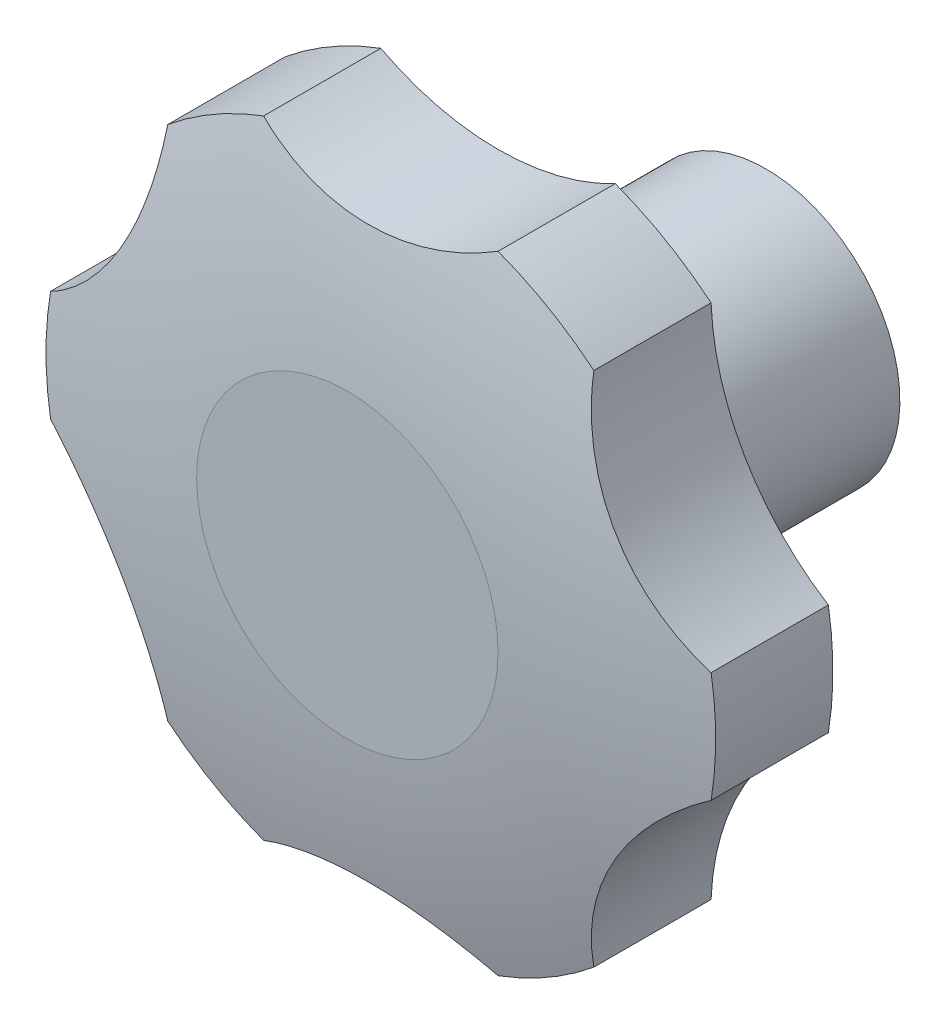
ISO-10303-21;
HEADER;
FILE_DESCRIPTION(('STEP AP214'),'2;1');
FILE_NAME('part.step','',(''),(''),'','','');
FILE_SCHEMA(('AUTOMOTIVE_DESIGN { 1 0 10303 214 1 1 1 1 }'));
ENDSEC;
DATA;
#1=APPLICATION_CONTEXT('core data for automotive mechanical design processes');
#2=APPLICATION_PROTOCOL_DEFINITION('international standard','automotive_design',2000,#1);
#3=PRODUCT_CONTEXT('',#1,'mechanical');
#4=PRODUCT('Part','Part','',(#3));
#5=PRODUCT_RELATED_PRODUCT_CATEGORY('part','',(#4));
#6=PRODUCT_DEFINITION_FORMATION('','',#4);
#7=PRODUCT_DEFINITION_CONTEXT('part definition',#1,'design');
#8=PRODUCT_DEFINITION('design','',#6,#7);
#9=PRODUCT_DEFINITION_SHAPE('','',#8);
#10=(LENGTH_UNIT() NAMED_UNIT(*) SI_UNIT(.MILLI.,.METRE.));
#11=(NAMED_UNIT(*) PLANE_ANGLE_UNIT() SI_UNIT($,.RADIAN.));
#12=(NAMED_UNIT(*) SI_UNIT($,.STERADIAN.) SOLID_ANGLE_UNIT());
#13=UNCERTAINTY_MEASURE_WITH_UNIT(LENGTH_MEASURE(1.E-05),#10,'distance_accuracy_value','');
#14=(GEOMETRIC_REPRESENTATION_CONTEXT(3) GLOBAL_UNCERTAINTY_ASSIGNED_CONTEXT((#13)) GLOBAL_UNIT_ASSIGNED_CONTEXT((#10,
#11,#12)) REPRESENTATION_CONTEXT('',''));
#15=CARTESIAN_POINT('',(0.,0.,0.));
#16=DIRECTION('',(0.,0.,1.));
#17=DIRECTION('',(1.,0.,0.));
#18=AXIS2_PLACEMENT_3D('',#15,#16,#17);
#19=CARTESIAN_POINT('',(0.,0.,30.));
#20=DIRECTION('',(0.,0.,1.));
#21=DIRECTION('',(0.,-1.,0.));
#22=AXIS2_PLACEMENT_3D('',#19,#20,#21);
#23=CYLINDRICAL_SURFACE('',#22,20.);
#24=DIRECTION('',(0.,0.,1.));
#25=VECTOR('',#24,1.);
#26=CARTESIAN_POINT('',(19.725272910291,-3.30357512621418,19.5));
#27=LINE('',#26,#25);
#28=CARTESIAN_POINT('',(19.725272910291,-3.30357512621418,16.));
#29=VERTEX_POINT('',#28);
#30=CARTESIAN_POINT('',(19.725272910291,-3.30357512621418,23.));
#31=VERTEX_POINT('',#30);
#32=EDGE_CURVE('E35',#29,#31,#27,.T.);
#33=ORIENTED_EDGE('',*,*,#32,.F.);
#34=CARTESIAN_POINT('',(0.,0.,16.));
#35=DIRECTION('',(0.,0.,1.));
#36=DIRECTION('',(0.,-1.,0.));
#37=AXIS2_PLACEMENT_3D('',#34,#35,#36);
#38=CIRCLE('',#37,20.);
#39=CARTESIAN_POINT('',(19.7252729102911,3.30357512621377,16.));
#40=VERTEX_POINT('',#39);
#41=EDGE_CURVE('E120',#29,#40,#38,.T.);
#42=ORIENTED_EDGE('',*,*,#41,.T.);
#43=DIRECTION('',(0.,0.,1.));
#44=VECTOR('',#43,1.);
#45=CARTESIAN_POINT('',(19.7252729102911,3.30357512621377,20.5));
#46=LINE('',#45,#44);
#47=CARTESIAN_POINT('',(19.7252729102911,3.30357512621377,23.));
#48=VERTEX_POINT('',#47);
#49=EDGE_CURVE('E257',#48,#40,#46,.F.);
#50=ORIENTED_EDGE('',*,*,#49,.F.);
#51=CARTESIAN_POINT('',(0.,0.,23.));
#52=DIRECTION('',(0.,0.,1.));
#53=DIRECTION('',(0.,-1.,0.));
#54=AXIS2_PLACEMENT_3D('',#51,#52,#53);
#55=CIRCLE('',#54,20.);
#56=EDGE_CURVE('E122',#31,#48,#55,.T.);
#57=ORIENTED_EDGE('',*,*,#56,.F.);
#58=EDGE_LOOP('',(#33,#42,#50,#57));
#59=FACE_BOUND('',#58,.T.);
#60=ADVANCED_FACE('F14',(#59),#23,.T.);
#61=DIRECTION('',(0.,0.,1.));
#62=VECTOR('',#61,1.);
#63=CARTESIAN_POINT('',(12.7236164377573,15.430799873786,20.5));
#64=LINE('',#63,#62);
#65=CARTESIAN_POINT('',(12.7236164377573,15.430799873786,16.));
#66=VERTEX_POINT('',#65);
#67=CARTESIAN_POINT('',(12.7236164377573,15.430799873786,23.));
#68=VERTEX_POINT('',#67);
#69=EDGE_CURVE('E42',#66,#68,#64,.T.);
#70=ORIENTED_EDGE('',*,*,#69,.F.);
#71=CARTESIAN_POINT('',(7.00165647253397,18.734375,16.));
#72=VERTEX_POINT('',#71);
#73=EDGE_CURVE('E130',#66,#72,#38,.T.);
#74=ORIENTED_EDGE('',*,*,#73,.T.);
#75=DIRECTION('',(0.,0.,1.));
#76=VECTOR('',#75,1.);
#77=CARTESIAN_POINT('',(7.00165647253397,18.734375,20.5));
#78=LINE('',#77,#76);
#79=CARTESIAN_POINT('',(7.00165647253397,18.734375,23.));
#80=VERTEX_POINT('',#79);
#81=EDGE_CURVE('E250',#80,#72,#78,.F.);
#82=ORIENTED_EDGE('',*,*,#81,.F.);
#83=EDGE_CURVE('E225',#68,#80,#55,.T.);
#84=ORIENTED_EDGE('',*,*,#83,.F.);
#85=EDGE_LOOP('',(#70,#74,#82,#84));
#86=FACE_BOUND('',#85,.T.);
#87=ADVANCED_FACE('F181',(#86),#23,.T.);
#88=DIRECTION('',(0.,0.,1.));
#89=VECTOR('',#88,1.);
#90=CARTESIAN_POINT('',(-7.00165647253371,18.734375,20.5));
#91=LINE('',#90,#89);
#92=CARTESIAN_POINT('',(-7.00165647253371,18.734375,16.));
#93=VERTEX_POINT('',#92);
#94=CARTESIAN_POINT('',(-7.00165647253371,18.734375,23.));
#95=VERTEX_POINT('',#94);
#96=EDGE_CURVE('E248',#93,#95,#91,.T.);
#97=ORIENTED_EDGE('',*,*,#96,.F.);
#98=CARTESIAN_POINT('',(-12.7236164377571,15.4307998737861,16.));
#99=VERTEX_POINT('',#98);
#100=EDGE_CURVE('E134',#93,#99,#38,.T.);
#101=ORIENTED_EDGE('',*,*,#100,.T.);
#102=DIRECTION('',(0.,0.,1.));
#103=VECTOR('',#102,1.);
#104=CARTESIAN_POINT('',(-12.7236164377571,15.4307998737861,20.5));
#105=LINE('',#104,#103);
#106=CARTESIAN_POINT('',(-12.7236164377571,15.4307998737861,23.));
#107=VERTEX_POINT('',#106);
#108=EDGE_CURVE('E242',#107,#99,#105,.F.);
#109=ORIENTED_EDGE('',*,*,#108,.F.);
#110=EDGE_CURVE('E229',#95,#107,#55,.T.);
#111=ORIENTED_EDGE('',*,*,#110,.F.);
#112=EDGE_LOOP('',(#97,#101,#109,#111));
#113=FACE_BOUND('',#112,.T.);
#114=ADVANCED_FACE('F185',(#113),#23,.T.);
#115=DIRECTION('',(0.,0.,1.));
#116=VECTOR('',#115,1.);
#117=CARTESIAN_POINT('',(-19.725272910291,3.30357512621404,20.5));
#118=LINE('',#117,#116);
#119=CARTESIAN_POINT('',(-19.725272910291,3.30357512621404,16.));
#120=VERTEX_POINT('',#119);
#121=CARTESIAN_POINT('',(-19.725272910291,3.30357512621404,23.));
#122=VERTEX_POINT('',#121);
#123=EDGE_CURVE('E240',#120,#122,#118,.T.);
#124=ORIENTED_EDGE('',*,*,#123,.F.);
#125=CARTESIAN_POINT('',(-19.7252729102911,-3.30357512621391,16.));
#126=VERTEX_POINT('',#125);
#127=EDGE_CURVE('E221',#120,#126,#38,.T.);
#128=ORIENTED_EDGE('',*,*,#127,.T.);
#129=DIRECTION('',(0.,0.,1.));
#130=VECTOR('',#129,1.);
#131=CARTESIAN_POINT('',(-19.725272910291,-3.30357512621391,19.5));
#132=LINE('',#131,#130);
#133=CARTESIAN_POINT('',(-19.7252729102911,-3.30357512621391,23.));
#134=VERTEX_POINT('',#133);
#135=EDGE_CURVE('E215',#134,#126,#132,.F.);
#136=ORIENTED_EDGE('',*,*,#135,.F.);
#137=EDGE_CURVE('E226',#122,#134,#55,.T.);
#138=ORIENTED_EDGE('',*,*,#137,.F.);
#139=EDGE_LOOP('',(#124,#128,#136,#138));
#140=FACE_BOUND('',#139,.T.);
#141=ADVANCED_FACE('F196',(#140),#23,.T.);
#142=DIRECTION('',(0.,0.,1.));
#143=VECTOR('',#142,1.);
#144=CARTESIAN_POINT('',(-12.7236164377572,-15.430799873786,19.5));
#145=LINE('',#144,#143);
#146=CARTESIAN_POINT('',(-12.7236164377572,-15.430799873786,16.));
#147=VERTEX_POINT('',#146);
#148=CARTESIAN_POINT('',(-12.7236164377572,-15.430799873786,23.));
#149=VERTEX_POINT('',#148);
#150=EDGE_CURVE('E206',#147,#149,#145,.T.);
#151=ORIENTED_EDGE('',*,*,#150,.F.);
#152=CARTESIAN_POINT('',(-7.00165647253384,-18.734375,16.));
#153=VERTEX_POINT('',#152);
#154=EDGE_CURVE('E133',#147,#153,#38,.T.);
#155=ORIENTED_EDGE('',*,*,#154,.T.);
#156=DIRECTION('',(0.,0.,1.));
#157=VECTOR('',#156,1.);
#158=CARTESIAN_POINT('',(-7.00165647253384,-18.734375,19.5));
#159=LINE('',#158,#157);
#160=CARTESIAN_POINT('',(-7.00165647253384,-18.734375,23.));
#161=VERTEX_POINT('',#160);
#162=EDGE_CURVE('E232',#161,#153,#159,.F.);
#163=ORIENTED_EDGE('',*,*,#162,.F.);
#164=EDGE_CURVE('E210',#149,#161,#55,.T.);
#165=ORIENTED_EDGE('',*,*,#164,.F.);
#166=EDGE_LOOP('',(#151,#155,#163,#165));
#167=FACE_BOUND('',#166,.T.);
#168=ADVANCED_FACE('F190',(#167),#23,.T.);
#169=CARTESIAN_POINT('',(0.,0.,0.));
#170=DIRECTION('',(0.,0.,1.));
#171=DIRECTION('',(0.,-1.,0.));
#172=AXIS2_PLACEMENT_3D('',#169,#170,#171);
#173=PLANE('',#172);
#174=CARTESIAN_POINT('',(0.,0.,0.));
#175=DIRECTION('',(0.,0.,-1.));
#176=DIRECTION('',(0.,1.,0.));
#177=AXIS2_PLACEMENT_3D('',#174,#175,#176);
#178=CIRCLE('',#177,2.5);
#179=CARTESIAN_POINT('',(0.,2.5,0.));
#180=VERTEX_POINT('',#179);
#181=EDGE_CURVE('E115',#180,#180,#178,.T.);
#182=ORIENTED_EDGE('',*,*,#181,.F.);
#183=EDGE_LOOP('',(#182));
#184=FACE_BOUND('',#183,.T.);
#185=CARTESIAN_POINT('',(0.,0.,0.));
#186=DIRECTION('',(0.,0.,1.));
#187=DIRECTION('',(0.,-1.,0.));
#188=AXIS2_PLACEMENT_3D('',#185,#186,#187);
#189=CIRCLE('',#188,8.);
#190=CARTESIAN_POINT('',(0.,-8.,0.));
#191=VERTEX_POINT('',#190);
#192=EDGE_CURVE('E141',#191,#191,#189,.T.);
#193=ORIENTED_EDGE('',*,*,#192,.F.);
#194=EDGE_LOOP('',(#193));
#195=FACE_BOUND('',#194,.T.);
#196=ADVANCED_FACE('F16',(#184,#195),#173,.F.);
#197=CARTESIAN_POINT('',(0.,0.,30.));
#198=DIRECTION('',(0.,0.,1.));
#199=DIRECTION('',(0.,-1.,0.));
#200=AXIS2_PLACEMENT_3D('',#197,#198,#199);
#201=CYLINDRICAL_SURFACE('',#200,8.);
#202=CARTESIAN_POINT('',(0.,0.,16.));
#203=DIRECTION('',(0.,0.,1.));
#204=DIRECTION('',(0.,-1.,0.));
#205=AXIS2_PLACEMENT_3D('',#202,#203,#204);
#206=CIRCLE('',#205,8.);
#207=CARTESIAN_POINT('',(0.,-8.,16.));
#208=VERTEX_POINT('',#207);
#209=EDGE_CURVE('E132',#208,#208,#206,.T.);
#210=ORIENTED_EDGE('',*,*,#209,.F.);
#211=EDGE_LOOP('',(#210));
#212=FACE_BOUND('',#211,.T.);
#213=ORIENTED_EDGE('',*,*,#192,.T.);
#214=EDGE_LOOP('',(#213));
#215=FACE_BOUND('',#214,.T.);
#216=ADVANCED_FACE('F194',(#212,#215),#201,.T.);
#217=CARTESIAN_POINT('',(8.,0.,16.));
#218=DIRECTION('',(0.,0.,1.));
#219=DIRECTION('',(0.,-1.,0.));
#220=AXIS2_PLACEMENT_3D('',#217,#218,#219);
#221=PLANE('',#220);
#222=ORIENTED_EDGE('',*,*,#41,.F.);
#223=CARTESIAN_POINT('',(27.7128129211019,-16.0000000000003,16.));
#224=DIRECTION('',(0.,0.,1.));
#225=DIRECTION('',(0.866025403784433,-0.50000000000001,0.));
#226=AXIS2_PLACEMENT_3D('',#223,#224,#225);
#227=CIRCLE('',#226,15.);
#228=CARTESIAN_POINT('',(12.723616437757,-15.4307998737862,16.));
#229=VERTEX_POINT('',#228);
#230=EDGE_CURVE('E107',#29,#229,#227,.T.);
#231=ORIENTED_EDGE('',*,*,#230,.T.);
#232=CARTESIAN_POINT('',(7.00165647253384,-18.734375,16.));
#233=VERTEX_POINT('',#232);
#234=EDGE_CURVE('E129',#233,#229,#38,.T.);
#235=ORIENTED_EDGE('',*,*,#234,.F.);
#236=CARTESIAN_POINT('',(0.,-32.,16.));
#237=DIRECTION('',(0.,0.,1.));
#238=DIRECTION('',(0.,-1.,0.));
#239=AXIS2_PLACEMENT_3D('',#236,#237,#238);
#240=CIRCLE('',#239,15.);
#241=EDGE_CURVE('E214',#233,#153,#240,.T.);
#242=ORIENTED_EDGE('',*,*,#241,.T.);
#243=ORIENTED_EDGE('',*,*,#154,.F.);
#244=CARTESIAN_POINT('',(-27.7128129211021,-16.,16.));
#245=DIRECTION('',(0.,0.,1.));
#246=DIRECTION('',(-0.86602540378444,-0.5,0.));
#247=AXIS2_PLACEMENT_3D('',#244,#245,#246);
#248=CIRCLE('',#247,15.);
#249=EDGE_CURVE('E220',#147,#126,#248,.T.);
#250=ORIENTED_EDGE('',*,*,#249,.T.);
#251=ORIENTED_EDGE('',*,*,#127,.F.);
#252=CARTESIAN_POINT('',(-27.7128129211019,16.,16.));
#253=DIRECTION('',(0.,0.,1.));
#254=DIRECTION('',(-0.866025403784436,0.5,0.));
#255=AXIS2_PLACEMENT_3D('',#252,#253,#254);
#256=CIRCLE('',#255,15.);
#257=EDGE_CURVE('E245',#120,#99,#256,.T.);
#258=ORIENTED_EDGE('',*,*,#257,.T.);
#259=ORIENTED_EDGE('',*,*,#100,.F.);
#260=CARTESIAN_POINT('',(2.23454935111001E-13,32.,16.));
#261=DIRECTION('',(0.,0.,1.));
#262=DIRECTION('',(0.,1.,0.));
#263=AXIS2_PLACEMENT_3D('',#260,#261,#262);
#264=CIRCLE('',#263,15.);
#265=EDGE_CURVE('E253',#93,#72,#264,.T.);
#266=ORIENTED_EDGE('',*,*,#265,.T.);
#267=ORIENTED_EDGE('',*,*,#73,.F.);
#268=CARTESIAN_POINT('',(27.7128129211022,15.9999999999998,16.));
#269=DIRECTION('',(0.,0.,1.));
#270=DIRECTION('',(0.866025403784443,0.499999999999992,0.));
#271=AXIS2_PLACEMENT_3D('',#268,#269,#270);
#272=CIRCLE('',#271,15.);
#273=EDGE_CURVE('E123',#66,#40,#272,.T.);
#274=ORIENTED_EDGE('',*,*,#273,.T.);
#275=EDGE_LOOP('',(#222,#231,#235,#242,#243,#250,#251,#258,#259,#266,#267,#274));
#276=FACE_BOUND('',#275,.T.);
#277=ORIENTED_EDGE('',*,*,#209,.T.);
#278=EDGE_LOOP('',(#277));
#279=FACE_BOUND('',#278,.T.);
#280=ADVANCED_FACE('F126',(#276,#279),#221,.F.);
#281=DIRECTION('',(0.,0.,1.));
#282=VECTOR('',#281,1.);
#283=CARTESIAN_POINT('',(12.723616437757,-15.4307998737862,19.5));
#284=LINE('',#283,#282);
#285=CARTESIAN_POINT('',(12.723616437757,-15.4307998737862,23.));
#286=VERTEX_POINT('',#285);
#287=EDGE_CURVE('E110',#286,#229,#284,.F.);
#288=ORIENTED_EDGE('',*,*,#287,.F.);
#289=CARTESIAN_POINT('',(7.00165647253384,-18.734375,23.));
#290=VERTEX_POINT('',#289);
#291=EDGE_CURVE('E137',#290,#286,#55,.T.);
#292=ORIENTED_EDGE('',*,*,#291,.F.);
#293=DIRECTION('',(0.,0.,1.));
#294=VECTOR('',#293,1.);
#295=CARTESIAN_POINT('',(7.00165647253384,-18.734375,19.5));
#296=LINE('',#295,#294);
#297=EDGE_CURVE('E230',#233,#290,#296,.T.);
#298=ORIENTED_EDGE('',*,*,#297,.F.);
#299=ORIENTED_EDGE('',*,*,#234,.T.);
#300=EDGE_LOOP('',(#288,#292,#298,#299));
#301=FACE_BOUND('',#300,.T.);
#302=ADVANCED_FACE('F177',(#301),#23,.T.);
#303=CARTESIAN_POINT('',(0.,0.,-34.7754200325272));
#304=DIRECTION('',(0.,0.,1.));
#305=DIRECTION('',(0.,-1.,0.));
#306=AXIS2_PLACEMENT_3D('',#303,#304,#305);
#307=DEGENERATE_TOROIDAL_SURFACE('',#306,3.81355999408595,60.,.T.);
#308=CARTESIAN_POINT('',(0.,0.,25.));
#309=DIRECTION('',(0.,0.,1.));
#310=DIRECTION('',(0.,-1.,0.));
#311=AXIS2_PLACEMENT_3D('',#308,#309,#310);
#312=CIRCLE('',#311,9.);
#313=CARTESIAN_POINT('',(0.,-9.,25.));
#314=VERTEX_POINT('',#313);
#315=EDGE_CURVE('E227',#314,#314,#312,.T.);
#316=ORIENTED_EDGE('',*,*,#315,.F.);
#317=EDGE_LOOP('',(#316));
#318=FACE_BOUND('',#317,.T.);
#319=ORIENTED_EDGE('',*,*,#291,.T.);
#320=CARTESIAN_POINT('',(12.7235801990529,-15.4317549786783,22.9998));
#321=CARTESIAN_POINT('',(12.731643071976,-15.2190560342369,23.0443428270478));
#322=CARTESIAN_POINT('',(12.7442494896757,-15.0061613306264,23.0869884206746));
#323=CARTESIAN_POINT('',(12.7786141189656,-14.5803741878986,23.1684407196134));
#324=CARTESIAN_POINT('',(12.8003724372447,-14.3674817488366,23.2072473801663));
#325=CARTESIAN_POINT('',(12.8794694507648,-13.7294254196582,23.3178374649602));
#326=CARTESIAN_POINT('',(12.9506309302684,-13.3048629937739,23.3837950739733));
#327=CARTESIAN_POINT('',(13.1295422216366,-12.4626088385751,23.499669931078));
#328=CARTESIAN_POINT('',(13.2371900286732,-12.0449013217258,23.5496311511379));
#329=CARTESIAN_POINT('',(13.4886260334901,-11.2189142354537,23.6336334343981));
#330=CARTESIAN_POINT('',(13.6324073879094,-10.8106328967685,23.6676775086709));
#331=CARTESIAN_POINT('',(13.9409940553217,-10.0423933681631,23.7175269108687));
#332=CARTESIAN_POINT('',(14.1028550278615,-9.68133477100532,23.7346685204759));
#333=CARTESIAN_POINT('',(14.4547808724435,-8.97283754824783,23.7556720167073));
#334=CARTESIAN_POINT('',(14.644844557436,-8.6253983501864,23.7595344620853));
#335=CARTESIAN_POINT('',(15.0517637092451,-7.94678085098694,23.7539814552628));
#336=CARTESIAN_POINT('',(15.2686143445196,-7.61559963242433,23.744568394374));
#337=CARTESIAN_POINT('',(15.7274647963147,-6.97184030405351,23.7124675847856));
#338=CARTESIAN_POINT('',(15.9694638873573,-6.65926165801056,23.6897802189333));
#339=CARTESIAN_POINT('',(16.4748083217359,-6.05713406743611,23.6313579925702));
#340=CARTESIAN_POINT('',(16.7379819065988,-5.76743141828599,23.5957212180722));
#341=CARTESIAN_POINT('',(17.2851098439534,-5.21040088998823,23.5114304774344));
#342=CARTESIAN_POINT('',(17.5690654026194,-4.94307431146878,23.462775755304));
#343=CARTESIAN_POINT('',(18.1560265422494,-4.43196238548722,23.3524643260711));
#344=CARTESIAN_POINT('',(18.4590652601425,-4.18821996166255,23.2907845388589));
#345=CARTESIAN_POINT('',(18.9256137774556,-3.84176407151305,23.1887518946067));
#346=CARTESIAN_POINT('',(19.0831380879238,-3.72946561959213,23.1531531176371));
#347=CARTESIAN_POINT('',(19.4018964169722,-3.51136708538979,23.0788199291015));
#348=CARTESIAN_POINT('',(19.5631303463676,-3.40556684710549,23.0400855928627));
#349=CARTESIAN_POINT('',(19.7260819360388,-3.30306619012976,22.9998));
#350=B_SPLINE_CURVE_WITH_KNOTS('',3,(#320,#321,#322,#323,#324,#325,#326,#327,#328,#329,#330,
#331,#332,#333,#334,#335,#336,#337,#338,#339,#340,#341,#342,#343,#344,#345,#346,#347,#348,#349),
.UNSPECIFIED.,.F.,.F.,(4,2,2,2,2,2,2,2,2,2,2,2,2,2,4),(0.,0.652272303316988,1.30455221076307,
2.60905237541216,3.90993522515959,5.210571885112,6.39729252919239,7.58396323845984,
8.77042022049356,9.95684298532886,11.1344603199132,12.3121460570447,13.4919364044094,
14.081901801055,14.6718530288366),.UNSPECIFIED.);
#351=EDGE_CURVE('E9',#286,#31,#350,.T.);
#352=ORIENTED_EDGE('',*,*,#351,.T.);
#353=ORIENTED_EDGE('',*,*,#56,.T.);
#354=CARTESIAN_POINT('',(19.7260819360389,3.30306619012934,22.9998));
#355=CARTESIAN_POINT('',(19.545910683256,3.41639831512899,23.0443428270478));
#356=CARTESIAN_POINT('',(19.3678416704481,3.5337631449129,23.0869884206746));
#357=CARTESIAN_POINT('',(19.0162815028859,3.77641735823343,23.1684407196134));
#358=CARTESIAN_POINT('',(18.8427904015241,3.9017068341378,23.2072473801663));
#359=CARTESIAN_POINT('',(18.3297659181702,4.28923502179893,23.3178374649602));
#360=CARTESIAN_POINT('',(17.9976648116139,4.56314388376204,23.3837950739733));
#361=CARTESIAN_POINT('',(17.3577069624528,5.13921268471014,23.499669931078));
#362=CARTESIAN_POINT('',(17.049785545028,5.44129217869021,23.5496311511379));
#363=CARTESIAN_POINT('',(16.4601777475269,6.07203568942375,23.6336334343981));
#364=CARTESIAN_POINT('',(16.178486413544,6.40069466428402,23.6676775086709));
#365=CARTESIAN_POINT('',(15.6674647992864,7.05205832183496,23.7175269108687));
#366=CARTESIAN_POINT('',(15.435709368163,7.37276333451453,23.7346685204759));
#367=CARTESIAN_POINT('',(14.9980956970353,8.03178866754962,23.7556720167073));
#368=CARTESIAN_POINT('',(14.7922363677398,8.37010824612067,23.7595344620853));
#369=CARTESIAN_POINT('',(14.407995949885,9.06181931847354,23.7539814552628));
#370=CARTESIAN_POINT('',(14.2296099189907,9.41520808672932,23.744568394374));
#371=CARTESIAN_POINT('',(13.9015232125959,10.1344638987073,23.7124675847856));
#372=CARTESIAN_POINT('',(13.7518217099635,10.5003305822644,23.6897802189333));
#373=CARTESIAN_POINT('',(13.4830361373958,11.2390354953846,23.6313579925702));
#374=CARTESIAN_POINT('',(13.3637330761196,11.6118018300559,23.5957212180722));
#375=CARTESIAN_POINT('',(13.1548944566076,12.364143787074,23.5114304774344));
#376=CARTESIAN_POINT('',(13.065360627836,12.7437198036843,23.462775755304));
#377=CARTESIAN_POINT('',(12.9162052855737,13.5075990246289,23.3524643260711));
#378=CARTESIAN_POINT('',(12.8566375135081,13.891909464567,23.2907845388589));
#379=CARTESIAN_POINT('',(12.7898721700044,14.4691802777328,23.1887518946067));
#380=CARTESIAN_POINT('',(12.7713810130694,14.6617495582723,23.1531531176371));
#381=CARTESIAN_POINT('',(12.7418813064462,15.0468516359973,23.0788199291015));
#382=CARTESIAN_POINT('',(12.7308725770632,15.2393844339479,23.0400855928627));
#383=CARTESIAN_POINT('',(12.7235801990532,15.4317549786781,22.9998));
#384=B_SPLINE_CURVE_WITH_KNOTS('',3,(#354,#355,#356,#357,#358,#359,#360,#361,#362,#363,#364,
#365,#366,#367,#368,#369,#370,#371,#372,#373,#374,#375,#376,#377,#378,#379,#380,#381,#382,#383),
.UNSPECIFIED.,.F.,.F.,(4,2,2,2,2,2,2,2,2,2,2,2,2,2,4),(0.,0.652272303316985,1.30455221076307,
2.60905237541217,3.9099352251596,5.21057188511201,6.3972925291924,7.58396323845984,
8.77042022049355,9.95684298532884,11.1344603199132,12.3121460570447,13.4919364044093,
14.081901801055,14.6718530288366),.UNSPECIFIED.);
#385=EDGE_CURVE('E28',#48,#68,#384,.T.);
#386=ORIENTED_EDGE('',*,*,#385,.T.);
#387=ORIENTED_EDGE('',*,*,#83,.T.);
#388=CARTESIAN_POINT('',(7.00250173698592,18.7348211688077,22.9998));
#389=CARTESIAN_POINT('',(6.81426761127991,18.6354543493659,23.0443428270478));
#390=CARTESIAN_POINT('',(6.62359218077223,18.5399244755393,23.0869884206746));
#391=CARTESIAN_POINT('',(6.23766738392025,18.356791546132,23.1684407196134));
#392=CARTESIAN_POINT('',(6.04241796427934,18.2691885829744,23.2072473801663));
#393=CARTESIAN_POINT('',(5.45029646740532,18.0186604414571,23.3178374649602));
#394=CARTESIAN_POINT('',(5.04703388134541,17.8680068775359,23.3837950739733));
#395=CARTESIAN_POINT('',(4.22816474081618,17.6018215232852,23.499669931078));
#396=CARTESIAN_POINT('',(3.81259551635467,17.486193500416,23.5496311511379));
#397=CARTESIAN_POINT('',(2.97155171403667,17.2909499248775,23.6336334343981));
#398=CARTESIAN_POINT('',(2.5460790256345,17.2113275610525,23.6676775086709));
#399=CARTESIAN_POINT('',(1.72647074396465,17.094451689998,23.7175269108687));
#400=CARTESIAN_POINT('',(1.33285434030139,17.0540981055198,23.7346685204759));
#401=CARTESIAN_POINT('',(0.543314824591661,17.0046262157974,23.7556720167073));
#402=CARTESIAN_POINT('',(0.147391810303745,16.995506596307,23.7595344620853));
#403=CARTESIAN_POINT('',(-0.643767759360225,17.0086001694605,23.7539814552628));
#404=CARTESIAN_POINT('',(-1.03900442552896,17.0308077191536,23.744568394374));
#405=CARTESIAN_POINT('',(-1.82594158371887,17.1063042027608,23.7124675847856));
#406=CARTESIAN_POINT('',(-2.21764217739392,17.1595922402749,23.6897802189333));
#407=CARTESIAN_POINT('',(-2.99177218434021,17.2961695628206,23.6313579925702));
#408=CARTESIAN_POINT('',(-3.37424883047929,17.3792332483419,23.5957212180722));
#409=CARTESIAN_POINT('',(-4.13021538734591,17.5745446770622,23.5114304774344));
#410=CARTESIAN_POINT('',(-4.50370477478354,17.6867941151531,23.462775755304));
#411=CARTESIAN_POINT('',(-5.23982125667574,17.9395614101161,23.3524643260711));
#412=CARTESIAN_POINT('',(-5.60242774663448,18.0801294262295,23.2907845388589));
#413=CARTESIAN_POINT('',(-6.13574160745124,18.3109443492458,23.1887518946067));
#414=CARTESIAN_POINT('',(-6.31175707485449,18.3912151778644,23.1531531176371));
#415=CARTESIAN_POINT('',(-6.66001511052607,18.5582187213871,23.0788199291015));
#416=CARTESIAN_POINT('',(-6.83225776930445,18.6449512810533,23.0400855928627));
#417=CARTESIAN_POINT('',(-7.00250173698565,18.7348211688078,22.9998));
#418=B_SPLINE_CURVE_WITH_KNOTS('',3,(#388,#389,#390,#391,#392,#393,#394,#395,#396,#397,#398,
#399,#400,#401,#402,#403,#404,#405,#406,#407,#408,#409,#410,#411,#412,#413,#414,#415,#416,#417),
.UNSPECIFIED.,.F.,.F.,(4,2,2,2,2,2,2,2,2,2,2,2,2,2,4),(0.,0.65227230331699,1.30455221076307,
2.60905237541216,3.9099352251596,5.21057188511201,6.39729252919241,7.58396323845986,
8.77042022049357,9.95684298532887,11.1344603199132,12.3121460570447,13.4919364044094,
14.081901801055,14.6718530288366),.UNSPECIFIED.);
#419=EDGE_CURVE('E291',#80,#95,#418,.T.);
#420=ORIENTED_EDGE('',*,*,#419,.T.);
#421=ORIENTED_EDGE('',*,*,#110,.T.);
#422=CARTESIAN_POINT('',(-12.723580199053,15.4317549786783,22.9998));
#423=CARTESIAN_POINT('',(-12.7316430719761,15.2190560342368,23.0443428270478));
#424=CARTESIAN_POINT('',(-12.7442494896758,15.0061613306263,23.0869884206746));
#425=CARTESIAN_POINT('',(-12.7786141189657,14.5803741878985,23.1684407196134));
#426=CARTESIAN_POINT('',(-12.8003724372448,14.3674817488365,23.2072473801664));
#427=CARTESIAN_POINT('',(-12.8794694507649,13.7294254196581,23.3178374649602));
#428=CARTESIAN_POINT('',(-12.9506309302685,13.3048629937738,23.3837950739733));
#429=CARTESIAN_POINT('',(-13.1295422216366,12.462608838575,23.499669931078));
#430=CARTESIAN_POINT('',(-13.2371900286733,12.0449013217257,23.5496311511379));
#431=CARTESIAN_POINT('',(-13.4886260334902,11.2189142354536,23.6336334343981));
#432=CARTESIAN_POINT('',(-13.6324073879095,10.8106328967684,23.6676775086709));
#433=CARTESIAN_POINT('',(-13.9409940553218,10.0423933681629,23.7175269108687));
#434=CARTESIAN_POINT('',(-14.1028550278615,9.6813347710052,23.7346685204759));
#435=CARTESIAN_POINT('',(-14.4547808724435,8.97283754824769,23.7556720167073));
#436=CARTESIAN_POINT('',(-14.644844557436,8.62539835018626,23.7595344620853));
#437=CARTESIAN_POINT('',(-15.0517637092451,7.94678085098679,23.7539814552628));
#438=CARTESIAN_POINT('',(-15.2686143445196,7.61559963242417,23.744568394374));
#439=CARTESIAN_POINT('',(-15.7274647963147,6.97184030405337,23.7124675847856));
#440=CARTESIAN_POINT('',(-15.9694638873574,6.65926165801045,23.6897802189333));
#441=CARTESIAN_POINT('',(-16.474808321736,6.05713406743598,23.6313579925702));
#442=CARTESIAN_POINT('',(-16.7379819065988,5.76743141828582,23.5957212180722));
#443=CARTESIAN_POINT('',(-17.2851098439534,5.21040088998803,23.5114304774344));
#444=CARTESIAN_POINT('',(-17.5690654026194,4.94307431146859,23.4627757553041));
#445=CARTESIAN_POINT('',(-18.1560265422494,4.43196238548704,23.3524643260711));
#446=CARTESIAN_POINT('',(-18.4590652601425,4.18821996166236,23.2907845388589));
#447=CARTESIAN_POINT('',(-18.9256137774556,3.84176407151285,23.1887518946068));
#448=CARTESIAN_POINT('',(-19.0831380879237,3.72946561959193,23.1531531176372));
#449=CARTESIAN_POINT('',(-19.4018964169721,3.5113670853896,23.0788199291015));
#450=CARTESIAN_POINT('',(-19.5631303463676,3.40556684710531,23.0400855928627));
#451=CARTESIAN_POINT('',(-19.7260819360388,3.30306619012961,22.9998));
#452=B_SPLINE_CURVE_WITH_KNOTS('',3,(#422,#423,#424,#425,#426,#427,#428,#429,#430,#431,#432,
#433,#434,#435,#436,#437,#438,#439,#440,#441,#442,#443,#444,#445,#446,#447,#448,#449,#450,#451),
.UNSPECIFIED.,.F.,.F.,(4,2,2,2,2,2,2,2,2,2,2,2,2,2,4),(0.,0.652272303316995,1.30455221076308,
2.60905237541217,3.90993522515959,5.210571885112,6.39729252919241,7.58396323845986,
8.77042022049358,9.95684298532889,11.1344603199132,12.3121460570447,13.4919364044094,
14.081901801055,14.6718530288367),.UNSPECIFIED.);
#453=EDGE_CURVE('E297',#107,#122,#452,.T.);
#454=ORIENTED_EDGE('',*,*,#453,.T.);
#455=ORIENTED_EDGE('',*,*,#137,.T.);
#456=CARTESIAN_POINT('',(-19.7260819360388,-3.30306619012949,22.9998));
#457=CARTESIAN_POINT('',(-19.545910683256,-3.41639831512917,23.0443428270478));
#458=CARTESIAN_POINT('',(-19.367841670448,-3.53376314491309,23.0869884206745));
#459=CARTESIAN_POINT('',(-19.0162815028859,-3.77641735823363,23.1684407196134));
#460=CARTESIAN_POINT('',(-18.8427904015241,-3.90170683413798,23.2072473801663));
#461=CARTESIAN_POINT('',(-18.3297659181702,-4.2892350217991,23.3178374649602));
#462=CARTESIAN_POINT('',(-17.9976648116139,-4.56314388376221,23.3837950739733));
#463=CARTESIAN_POINT('',(-17.3577069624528,-5.13921268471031,23.499669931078));
#464=CARTESIAN_POINT('',(-17.049785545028,-5.44129217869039,23.5496311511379));
#465=CARTESIAN_POINT('',(-16.4601777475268,-6.0720356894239,23.6336334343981));
#466=CARTESIAN_POINT('',(-16.1784864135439,-6.40069466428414,23.6676775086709));
#467=CARTESIAN_POINT('',(-15.6674647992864,-7.05205832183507,23.7175269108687));
#468=CARTESIAN_POINT('',(-15.4357093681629,-7.37276333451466,23.7346685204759));
#469=CARTESIAN_POINT('',(-14.9980956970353,-8.03178866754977,23.7556720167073));
#470=CARTESIAN_POINT('',(-14.7922363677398,-8.37010824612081,23.7595344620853));
#471=CARTESIAN_POINT('',(-14.4079959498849,-9.06181931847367,23.7539814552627));
#472=CARTESIAN_POINT('',(-14.2296099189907,-9.41520808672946,23.744568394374));
#473=CARTESIAN_POINT('',(-13.9015232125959,-10.1344638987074,23.7124675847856));
#474=CARTESIAN_POINT('',(-13.7518217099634,-10.5003305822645,23.6897802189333));
#475=CARTESIAN_POINT('',(-13.4830361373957,-11.2390354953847,23.6313579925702));
#476=CARTESIAN_POINT('',(-13.3637330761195,-11.611801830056,23.5957212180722));
#477=CARTESIAN_POINT('',(-13.1548944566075,-12.3641437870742,23.5114304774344));
#478=CARTESIAN_POINT('',(-13.0653606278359,-12.7437198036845,23.462775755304));
#479=CARTESIAN_POINT('',(-12.9162052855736,-13.507599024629,23.352464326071));
#480=CARTESIAN_POINT('',(-12.856637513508,-13.8919094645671,23.2907845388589));
#481=CARTESIAN_POINT('',(-12.7898721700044,-14.4691802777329,23.1887518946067));
#482=CARTESIAN_POINT('',(-12.7713810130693,-14.6617495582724,23.1531531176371));
#483=CARTESIAN_POINT('',(-12.7418813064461,-15.0468516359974,23.0788199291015));
#484=CARTESIAN_POINT('',(-12.7308725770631,-15.239384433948,23.0400855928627));
#485=CARTESIAN_POINT('',(-12.7235801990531,-15.4317549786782,22.9998));
#486=B_SPLINE_CURVE_WITH_KNOTS('',3,(#456,#457,#458,#459,#460,#461,#462,#463,#464,#465,#466,
#467,#468,#469,#470,#471,#472,#473,#474,#475,#476,#477,#478,#479,#480,#481,#482,#483,#484,#485),
.UNSPECIFIED.,.F.,.F.,(4,2,2,2,2,2,2,2,2,2,2,2,2,2,4),(0.,0.652272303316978,1.30455221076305,
2.60905237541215,3.90993522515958,5.21057188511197,6.39729252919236,7.58396323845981,
8.77042022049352,9.95684298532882,11.1344603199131,12.3121460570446,13.4919364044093,
14.081901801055,14.6718530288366),.UNSPECIFIED.);
#487=EDGE_CURVE('E152',#134,#149,#486,.T.);
#488=ORIENTED_EDGE('',*,*,#487,.T.);
#489=ORIENTED_EDGE('',*,*,#164,.T.);
#490=CARTESIAN_POINT('',(-7.00250173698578,-18.7348211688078,22.9998));
#491=CARTESIAN_POINT('',(-6.81426761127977,-18.6354543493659,23.0443428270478));
#492=CARTESIAN_POINT('',(-6.62359218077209,-18.5399244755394,23.0869884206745));
#493=CARTESIAN_POINT('',(-6.23766738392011,-18.3567915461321,23.1684407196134));
#494=CARTESIAN_POINT('',(-6.04241796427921,-18.2691885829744,23.2072473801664));
#495=CARTESIAN_POINT('',(-5.45029646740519,-18.0186604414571,23.3178374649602));
#496=CARTESIAN_POINT('',(-5.04703388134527,-17.868006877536,23.3837950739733));
#497=CARTESIAN_POINT('',(-4.22816474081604,-17.6018215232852,23.499669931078));
#498=CARTESIAN_POINT('',(-3.81259551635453,-17.4861935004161,23.5496311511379));
#499=CARTESIAN_POINT('',(-2.97155171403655,-17.2909499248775,23.6336334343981));
#500=CARTESIAN_POINT('',(-2.54607902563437,-17.2113275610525,23.6676775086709));
#501=CARTESIAN_POINT('',(-1.72647074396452,-17.094451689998,23.7175269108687));
#502=CARTESIAN_POINT('',(-1.33285434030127,-17.0540981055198,23.7346685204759));
#503=CARTESIAN_POINT('',(-0.543314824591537,-17.0046262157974,23.7556720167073));
#504=CARTESIAN_POINT('',(-0.147391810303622,-16.995506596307,23.7595344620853));
#505=CARTESIAN_POINT('',(0.643767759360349,-17.0086001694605,23.7539814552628));
#506=CARTESIAN_POINT('',(1.03900442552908,-17.0308077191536,23.744568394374));
#507=CARTESIAN_POINT('',(1.825941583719,-17.1063042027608,23.7124675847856));
#508=CARTESIAN_POINT('',(2.21764217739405,-17.1595922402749,23.6897802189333));
#509=CARTESIAN_POINT('',(2.99177218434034,-17.2961695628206,23.6313579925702));
#510=CARTESIAN_POINT('',(3.37424883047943,-17.3792332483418,23.5957212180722));
#511=CARTESIAN_POINT('',(4.13021538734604,-17.5745446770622,23.5114304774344));
#512=CARTESIAN_POINT('',(4.50370477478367,-17.6867941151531,23.462775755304));
#513=CARTESIAN_POINT('',(5.23982125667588,-17.9395614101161,23.3524643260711));
#514=CARTESIAN_POINT('',(5.60242774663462,-18.0801294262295,23.2907845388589));
#515=CARTESIAN_POINT('',(6.13574160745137,-18.3109443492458,23.1887518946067));
#516=CARTESIAN_POINT('',(6.31175707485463,-18.3912151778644,23.1531531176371));
#517=CARTESIAN_POINT('',(6.66001511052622,-18.558218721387,23.0788199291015));
#518=CARTESIAN_POINT('',(6.83225776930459,-18.6449512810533,23.0400855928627));
#519=CARTESIAN_POINT('',(7.0025017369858,-18.7348211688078,22.9998));
#520=B_SPLINE_CURVE_WITH_KNOTS('',3,(#490,#491,#492,#493,#494,#495,#496,#497,#498,#499,#500,
#501,#502,#503,#504,#505,#506,#507,#508,#509,#510,#511,#512,#513,#514,#515,#516,#517,#518,#519),
.UNSPECIFIED.,.F.,.F.,(4,2,2,2,2,2,2,2,2,2,2,2,2,2,4),(0.,0.652272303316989,1.30455221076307,
2.60905237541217,3.9099352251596,5.21057188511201,6.39729252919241,7.58396323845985,
8.77042022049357,9.95684298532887,11.1344603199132,12.3121460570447,13.4919364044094,
14.081901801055,14.6718530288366),.UNSPECIFIED.);
#521=EDGE_CURVE('E144',#161,#290,#520,.T.);
#522=ORIENTED_EDGE('',*,*,#521,.T.);
#523=EDGE_LOOP('',(#319,#352,#353,#386,#387,#420,#421,#454,#455,#488,#489,#522));
#524=FACE_BOUND('',#523,.T.);
#525=ADVANCED_FACE('F159',(#318,#524),#307,.T.);
#526=CARTESIAN_POINT('',(0.,0.,25.));
#527=DIRECTION('',(0.,0.,1.));
#528=DIRECTION('',(0.,-1.,0.));
#529=AXIS2_PLACEMENT_3D('',#526,#527,#528);
#530=PLANE('',#529);
#531=ORIENTED_EDGE('',*,*,#315,.T.);
#532=EDGE_LOOP('',(#531));
#533=FACE_BOUND('',#532,.T.);
#534=ADVANCED_FACE('F167',(#533),#530,.T.);
#535=CARTESIAN_POINT('',(0.,-32.,16.));
#536=DIRECTION('',(0.,0.,1.));
#537=DIRECTION('',(0.,-1.,0.));
#538=AXIS2_PLACEMENT_3D('',#535,#536,#537);
#539=CYLINDRICAL_SURFACE('',#538,15.);
#540=ORIENTED_EDGE('',*,*,#297,.T.);
#541=ORIENTED_EDGE('',*,*,#521,.F.);
#542=ORIENTED_EDGE('',*,*,#162,.T.);
#543=ORIENTED_EDGE('',*,*,#241,.F.);
#544=EDGE_LOOP('',(#540,#541,#542,#543));
#545=FACE_BOUND('',#544,.T.);
#546=ADVANCED_FACE('F163',(#545),#539,.F.);
#547=CARTESIAN_POINT('',(-27.7128129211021,-16.,16.));
#548=DIRECTION('',(0.,0.,1.));
#549=DIRECTION('',(0.,-1.,0.));
#550=AXIS2_PLACEMENT_3D('',#547,#548,#549);
#551=CYLINDRICAL_SURFACE('',#550,15.);
#552=ORIENTED_EDGE('',*,*,#150,.T.);
#553=ORIENTED_EDGE('',*,*,#487,.F.);
#554=ORIENTED_EDGE('',*,*,#135,.T.);
#555=ORIENTED_EDGE('',*,*,#249,.F.);
#556=EDGE_LOOP('',(#552,#553,#554,#555));
#557=FACE_BOUND('',#556,.T.);
#558=ADVANCED_FACE('F166',(#557),#551,.F.);
#559=CARTESIAN_POINT('',(-27.7128129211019,16.,16.));
#560=DIRECTION('',(0.,0.,1.));
#561=DIRECTION('',(0.,-1.,0.));
#562=AXIS2_PLACEMENT_3D('',#559,#560,#561);
#563=CYLINDRICAL_SURFACE('',#562,15.);
#564=ORIENTED_EDGE('',*,*,#123,.T.);
#565=ORIENTED_EDGE('',*,*,#453,.F.);
#566=ORIENTED_EDGE('',*,*,#108,.T.);
#567=ORIENTED_EDGE('',*,*,#257,.F.);
#568=EDGE_LOOP('',(#564,#565,#566,#567));
#569=FACE_BOUND('',#568,.T.);
#570=ADVANCED_FACE('F303',(#569),#563,.F.);
#571=CARTESIAN_POINT('',(2.23454935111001E-13,32.,16.));
#572=DIRECTION('',(0.,0.,1.));
#573=DIRECTION('',(0.,-1.,0.));
#574=AXIS2_PLACEMENT_3D('',#571,#572,#573);
#575=CYLINDRICAL_SURFACE('',#574,15.);
#576=ORIENTED_EDGE('',*,*,#96,.T.);
#577=ORIENTED_EDGE('',*,*,#419,.F.);
#578=ORIENTED_EDGE('',*,*,#81,.T.);
#579=ORIENTED_EDGE('',*,*,#265,.F.);
#580=EDGE_LOOP('',(#576,#577,#578,#579));
#581=FACE_BOUND('',#580,.T.);
#582=ADVANCED_FACE('F284',(#581),#575,.F.);
#583=CARTESIAN_POINT('',(27.7128129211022,15.9999999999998,16.));
#584=DIRECTION('',(0.,0.,1.));
#585=DIRECTION('',(0.,-1.,0.));
#586=AXIS2_PLACEMENT_3D('',#583,#584,#585);
#587=CYLINDRICAL_SURFACE('',#586,15.);
#588=ORIENTED_EDGE('',*,*,#69,.T.);
#589=ORIENTED_EDGE('',*,*,#385,.F.);
#590=ORIENTED_EDGE('',*,*,#49,.T.);
#591=ORIENTED_EDGE('',*,*,#273,.F.);
#592=EDGE_LOOP('',(#588,#589,#590,#591));
#593=FACE_BOUND('',#592,.T.);
#594=ADVANCED_FACE('F278',(#593),#587,.F.);
#595=CARTESIAN_POINT('',(27.7128129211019,-16.0000000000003,16.));
#596=DIRECTION('',(0.,0.,1.));
#597=DIRECTION('',(0.,-1.,0.));
#598=AXIS2_PLACEMENT_3D('',#595,#596,#597);
#599=CYLINDRICAL_SURFACE('',#598,15.);
#600=ORIENTED_EDGE('',*,*,#32,.T.);
#601=ORIENTED_EDGE('',*,*,#351,.F.);
#602=ORIENTED_EDGE('',*,*,#287,.T.);
#603=ORIENTED_EDGE('',*,*,#230,.F.);
#604=EDGE_LOOP('',(#600,#601,#602,#603));
#605=FACE_BOUND('',#604,.T.);
#606=ADVANCED_FACE('F108',(#605),#599,.F.);
#607=CARTESIAN_POINT('',(0.,0.,10.));
#608=DIRECTION('',(0.,0.,-1.));
#609=DIRECTION('',(0.,1.,0.));
#610=AXIS2_PLACEMENT_3D('',#607,#608,#609);
#611=CYLINDRICAL_SURFACE('',#610,2.5);
#612=ORIENTED_EDGE('',*,*,#181,.T.);
#613=EDGE_LOOP('',(#612));
#614=FACE_BOUND('',#613,.T.);
#615=CARTESIAN_POINT('',(0.,0.,16.));
#616=DIRECTION('',(0.,0.,-1.));
#617=DIRECTION('',(-1.,0.,0.));
#618=AXIS2_PLACEMENT_3D('',#615,#616,#617);
#619=CIRCLE('',#618,2.5);
#620=CARTESIAN_POINT('',(-2.5,0.,16.));
#621=VERTEX_POINT('',#620);
#622=EDGE_CURVE('E263',#621,#621,#619,.T.);
#623=ORIENTED_EDGE('',*,*,#622,.F.);
#624=EDGE_LOOP('',(#623));
#625=FACE_BOUND('',#624,.T.);
#626=ADVANCED_FACE('F269',(#614,#625),#611,.F.);
#627=CARTESIAN_POINT('',(0.,0.,16.));
#628=DIRECTION('',(0.,0.,-1.));
#629=DIRECTION('',(-1.,0.,0.));
#630=AXIS2_PLACEMENT_3D('',#627,#628,#629);
#631=PLANE('',#630);
#632=ORIENTED_EDGE('',*,*,#622,.T.);
#633=EDGE_LOOP('',(#632));
#634=FACE_BOUND('',#633,.T.);
#635=ADVANCED_FACE('F267',(#634),#631,.T.);
#636=CLOSED_SHELL('',(#60,#87,#114,#141,#168,#196,#216,#280,#302,#525,#534,#546,#558,#570,#582,
#594,#606,#626,#635));
#637=MANIFOLD_SOLID_BREP('B1',#636);
#638=ADVANCED_BREP_SHAPE_REPRESENTATION('',(#18,#637),#14);
#639=SHAPE_DEFINITION_REPRESENTATION(#9,#638);
ENDSEC;
END-ISO-10303-21;
